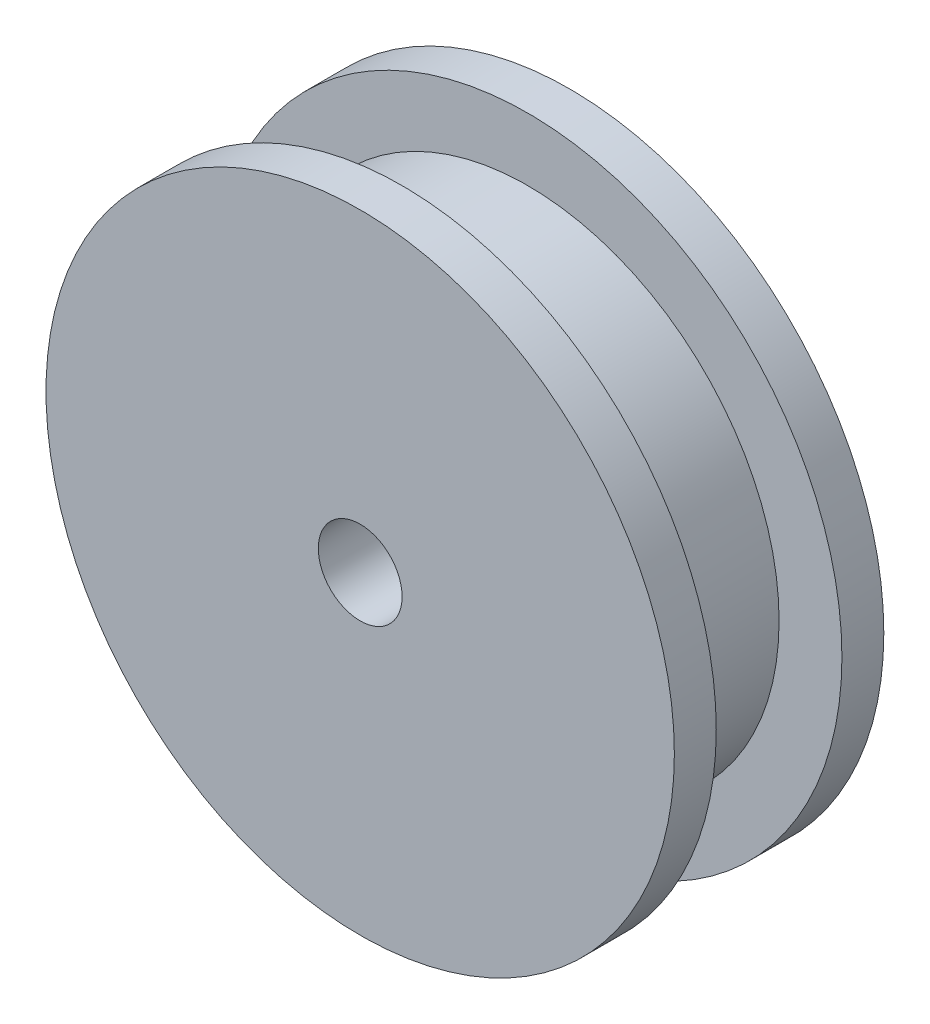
ISO-10303-21;
HEADER;
FILE_DESCRIPTION(('STEP AP214'),'2;1');
FILE_NAME('part.step','',(''),(''),'','','');
FILE_SCHEMA(('AUTOMOTIVE_DESIGN { 1 0 10303 214 1 1 1 1 }'));
ENDSEC;
DATA;
#1=APPLICATION_CONTEXT('core data for automotive mechanical design processes');
#2=APPLICATION_PROTOCOL_DEFINITION('international standard','automotive_design',2000,#1);
#3=PRODUCT_CONTEXT('',#1,'mechanical');
#4=PRODUCT('Part','Part','',(#3));
#5=PRODUCT_RELATED_PRODUCT_CATEGORY('part','',(#4));
#6=PRODUCT_DEFINITION_FORMATION('','',#4);
#7=PRODUCT_DEFINITION_CONTEXT('part definition',#1,'design');
#8=PRODUCT_DEFINITION('design','',#6,#7);
#9=PRODUCT_DEFINITION_SHAPE('','',#8);
#10=(LENGTH_UNIT() NAMED_UNIT(*) SI_UNIT(.MILLI.,.METRE.));
#11=(NAMED_UNIT(*) PLANE_ANGLE_UNIT() SI_UNIT($,.RADIAN.));
#12=(NAMED_UNIT(*) SI_UNIT($,.STERADIAN.) SOLID_ANGLE_UNIT());
#13=UNCERTAINTY_MEASURE_WITH_UNIT(LENGTH_MEASURE(1.E-05),#10,'distance_accuracy_value','');
#14=(GEOMETRIC_REPRESENTATION_CONTEXT(3) GLOBAL_UNCERTAINTY_ASSIGNED_CONTEXT((#13)) GLOBAL_UNIT_ASSIGNED_CONTEXT((#10,
#11,#12)) REPRESENTATION_CONTEXT('',''));
#15=CARTESIAN_POINT('',(0.,0.,0.));
#16=DIRECTION('',(0.,0.,1.));
#17=DIRECTION('',(1.,0.,0.));
#18=AXIS2_PLACEMENT_3D('',#15,#16,#17);
#19=CARTESIAN_POINT('',(0.,0.,51.1059460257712));
#20=DIRECTION('',(0.,0.,1.));
#21=DIRECTION('',(1.,0.,0.));
#22=AXIS2_PLACEMENT_3D('',#19,#20,#21);
#23=CYLINDRICAL_SURFACE('',#22,76.2);
#24=CARTESIAN_POINT('',(0.,0.,19.05));
#25=DIRECTION('',(0.,0.,1.));
#26=DIRECTION('',(1.,0.,0.));
#27=AXIS2_PLACEMENT_3D('',#24,#25,#26);
#28=CIRCLE('',#27,76.2);
#29=CARTESIAN_POINT('',(76.2,0.,19.05));
#30=VERTEX_POINT('',#29);
#31=EDGE_CURVE('E10',#30,#30,#28,.T.);
#32=ORIENTED_EDGE('',*,*,#31,.F.);
#33=EDGE_LOOP('',(#32));
#34=FACE_BOUND('',#33,.T.);
#35=CARTESIAN_POINT('',(0.,0.,-19.05));
#36=DIRECTION('',(0.,0.,1.));
#37=DIRECTION('',(1.,0.,0.));
#38=AXIS2_PLACEMENT_3D('',#35,#36,#37);
#39=CIRCLE('',#38,76.2);
#40=CARTESIAN_POINT('',(76.2,0.,-19.05));
#41=VERTEX_POINT('',#40);
#42=EDGE_CURVE('E55',#41,#41,#39,.T.);
#43=ORIENTED_EDGE('',*,*,#42,.T.);
#44=EDGE_LOOP('',(#43));
#45=FACE_BOUND('',#44,.T.);
#46=ADVANCED_FACE('F27',(#34,#45),#23,.T.);
#47=CARTESIAN_POINT('',(0.,76.2,19.05));
#48=DIRECTION('',(0.,0.,1.));
#49=DIRECTION('',(1.,0.,0.));
#50=AXIS2_PLACEMENT_3D('',#47,#48,#49);
#51=PLANE('',#50);
#52=CARTESIAN_POINT('',(0.,0.,19.05));
#53=DIRECTION('',(0.,0.,1.));
#54=DIRECTION('',(1.,0.,0.));
#55=AXIS2_PLACEMENT_3D('',#52,#53,#54);
#56=CIRCLE('',#55,95.25);
#57=CARTESIAN_POINT('',(95.25,0.,19.05));
#58=VERTEX_POINT('',#57);
#59=EDGE_CURVE('E33',#58,#58,#56,.T.);
#60=ORIENTED_EDGE('',*,*,#59,.F.);
#61=EDGE_LOOP('',(#60));
#62=FACE_BOUND('',#61,.T.);
#63=ORIENTED_EDGE('',*,*,#31,.T.);
#64=EDGE_LOOP('',(#63));
#65=FACE_BOUND('',#64,.T.);
#66=ADVANCED_FACE('F92',(#62,#65),#51,.F.);
#67=CARTESIAN_POINT('',(0.,0.,51.1059460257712));
#68=DIRECTION('',(0.,0.,1.));
#69=DIRECTION('',(1.,0.,0.));
#70=AXIS2_PLACEMENT_3D('',#67,#68,#69);
#71=CYLINDRICAL_SURFACE('',#70,95.25);
#72=CARTESIAN_POINT('',(0.,0.,31.75));
#73=DIRECTION('',(0.,0.,1.));
#74=DIRECTION('',(1.,0.,0.));
#75=AXIS2_PLACEMENT_3D('',#72,#73,#74);
#76=CIRCLE('',#75,95.25);
#77=CARTESIAN_POINT('',(95.25,0.,31.75));
#78=VERTEX_POINT('',#77);
#79=EDGE_CURVE('E37',#78,#78,#76,.T.);
#80=ORIENTED_EDGE('',*,*,#79,.F.);
#81=EDGE_LOOP('',(#80));
#82=FACE_BOUND('',#81,.T.);
#83=ORIENTED_EDGE('',*,*,#59,.T.);
#84=EDGE_LOOP('',(#83));
#85=FACE_BOUND('',#84,.T.);
#86=ADVANCED_FACE('F87',(#82,#85),#71,.T.);
#87=CARTESIAN_POINT('',(0.,95.25,31.75));
#88=DIRECTION('',(0.,0.,-1.));
#89=DIRECTION('',(-1.,0.,0.));
#90=AXIS2_PLACEMENT_3D('',#87,#88,#89);
#91=PLANE('',#90);
#92=CARTESIAN_POINT('',(0.,0.,31.75));
#93=DIRECTION('',(0.,0.,1.));
#94=DIRECTION('',(1.,0.,0.));
#95=AXIS2_PLACEMENT_3D('',#92,#93,#94);
#96=CIRCLE('',#95,12.7);
#97=CARTESIAN_POINT('',(12.7,0.,31.75));
#98=VERTEX_POINT('',#97);
#99=EDGE_CURVE('E41',#98,#98,#96,.T.);
#100=ORIENTED_EDGE('',*,*,#99,.F.);
#101=EDGE_LOOP('',(#100));
#102=FACE_BOUND('',#101,.T.);
#103=ORIENTED_EDGE('',*,*,#79,.T.);
#104=EDGE_LOOP('',(#103));
#105=FACE_BOUND('',#104,.T.);
#106=ADVANCED_FACE('F81',(#102,#105),#91,.F.);
#107=CARTESIAN_POINT('',(0.,0.,51.1059460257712));
#108=DIRECTION('',(0.,0.,1.));
#109=DIRECTION('',(1.,0.,0.));
#110=AXIS2_PLACEMENT_3D('',#107,#108,#109);
#111=CYLINDRICAL_SURFACE('',#110,12.7);
#112=CARTESIAN_POINT('',(0.,0.,-31.75));
#113=DIRECTION('',(0.,0.,1.));
#114=DIRECTION('',(1.,0.,0.));
#115=AXIS2_PLACEMENT_3D('',#112,#113,#114);
#116=CIRCLE('',#115,12.7);
#117=CARTESIAN_POINT('',(12.7,0.,-31.75));
#118=VERTEX_POINT('',#117);
#119=EDGE_CURVE('E46',#118,#118,#116,.T.);
#120=ORIENTED_EDGE('',*,*,#119,.F.);
#121=EDGE_LOOP('',(#120));
#122=FACE_BOUND('',#121,.T.);
#123=ORIENTED_EDGE('',*,*,#99,.T.);
#124=EDGE_LOOP('',(#123));
#125=FACE_BOUND('',#124,.T.);
#126=ADVANCED_FACE('F75',(#122,#125),#111,.F.);
#127=CARTESIAN_POINT('',(0.,95.25,-31.75));
#128=DIRECTION('',(0.,0.,1.));
#129=DIRECTION('',(1.,0.,0.));
#130=AXIS2_PLACEMENT_3D('',#127,#128,#129);
#131=PLANE('',#130);
#132=CARTESIAN_POINT('',(0.,0.,-31.75));
#133=DIRECTION('',(0.,0.,1.));
#134=DIRECTION('',(1.,0.,0.));
#135=AXIS2_PLACEMENT_3D('',#132,#133,#134);
#136=CIRCLE('',#135,95.25);
#137=CARTESIAN_POINT('',(95.25,0.,-31.75));
#138=VERTEX_POINT('',#137);
#139=EDGE_CURVE('E49',#138,#138,#136,.T.);
#140=ORIENTED_EDGE('',*,*,#139,.F.);
#141=EDGE_LOOP('',(#140));
#142=FACE_BOUND('',#141,.T.);
#143=ORIENTED_EDGE('',*,*,#119,.T.);
#144=EDGE_LOOP('',(#143));
#145=FACE_BOUND('',#144,.T.);
#146=ADVANCED_FACE('F69',(#142,#145),#131,.F.);
#147=CARTESIAN_POINT('',(0.,0.,51.1059460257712));
#148=DIRECTION('',(0.,0.,1.));
#149=DIRECTION('',(1.,0.,0.));
#150=AXIS2_PLACEMENT_3D('',#147,#148,#149);
#151=CYLINDRICAL_SURFACE('',#150,95.25);
#152=CARTESIAN_POINT('',(0.,0.,-19.05));
#153=DIRECTION('',(0.,0.,1.));
#154=DIRECTION('',(1.,0.,0.));
#155=AXIS2_PLACEMENT_3D('',#152,#153,#154);
#156=CIRCLE('',#155,95.25);
#157=CARTESIAN_POINT('',(95.25,0.,-19.05));
#158=VERTEX_POINT('',#157);
#159=EDGE_CURVE('E52',#158,#158,#156,.T.);
#160=ORIENTED_EDGE('',*,*,#159,.F.);
#161=EDGE_LOOP('',(#160));
#162=FACE_BOUND('',#161,.T.);
#163=ORIENTED_EDGE('',*,*,#139,.T.);
#164=EDGE_LOOP('',(#163));
#165=FACE_BOUND('',#164,.T.);
#166=ADVANCED_FACE('F63',(#162,#165),#151,.T.);
#167=CARTESIAN_POINT('',(0.,76.2,-19.05));
#168=DIRECTION('',(0.,0.,-1.));
#169=DIRECTION('',(-1.,0.,0.));
#170=AXIS2_PLACEMENT_3D('',#167,#168,#169);
#171=PLANE('',#170);
#172=ORIENTED_EDGE('',*,*,#42,.F.);
#173=EDGE_LOOP('',(#172));
#174=FACE_BOUND('',#173,.T.);
#175=ORIENTED_EDGE('',*,*,#159,.T.);
#176=EDGE_LOOP('',(#175));
#177=FACE_BOUND('',#176,.T.);
#178=ADVANCED_FACE('F60',(#174,#177),#171,.F.);
#179=CLOSED_SHELL('',(#46,#66,#86,#106,#126,#146,#166,#178));
#180=MANIFOLD_SOLID_BREP('B2',#179);
#181=ADVANCED_BREP_SHAPE_REPRESENTATION('',(#18,#180),#14);
#182=SHAPE_DEFINITION_REPRESENTATION(#9,#181);
ENDSEC;
END-ISO-10303-21;
